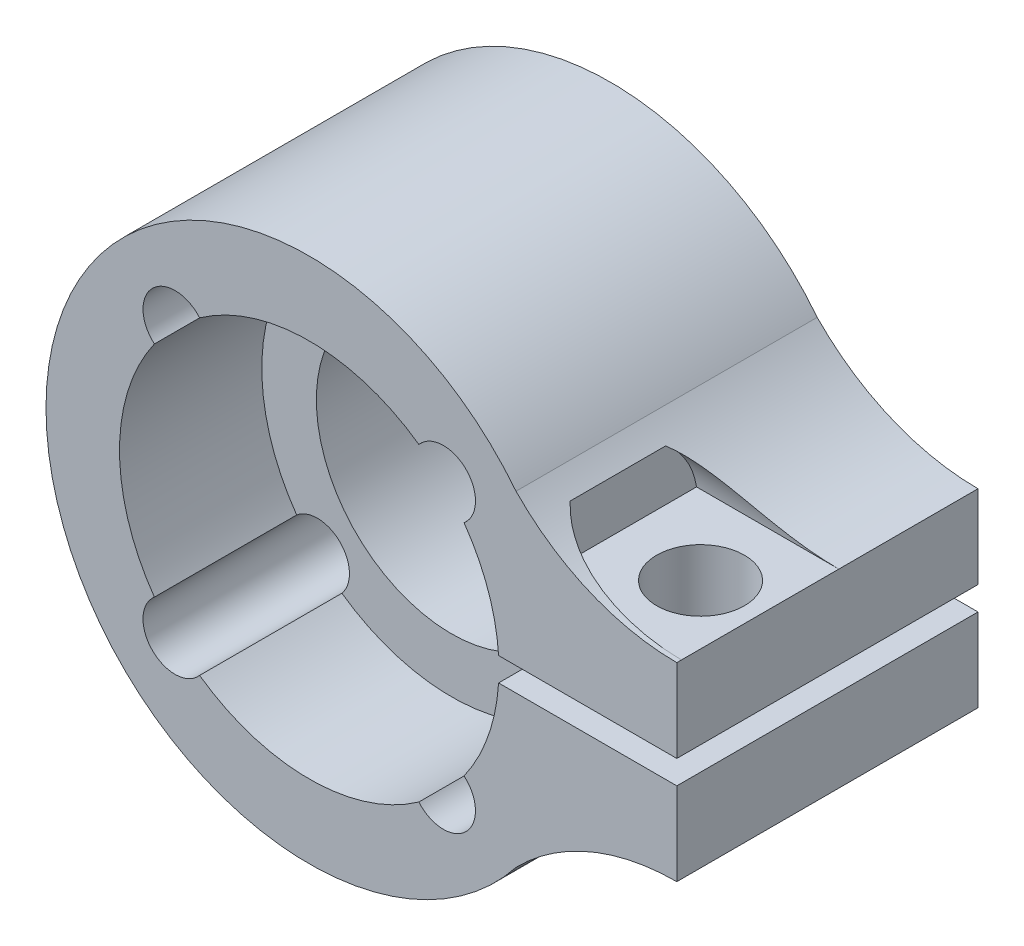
ISO-10303-21;
HEADER;
FILE_DESCRIPTION(('STEP AP214'),'2;1');
FILE_NAME('part.step','',(''),(''),'','','');
FILE_SCHEMA(('AUTOMOTIVE_DESIGN { 1 0 10303 214 1 1 1 1 }'));
ENDSEC;
DATA;
#1=APPLICATION_CONTEXT('core data for automotive mechanical design processes');
#2=APPLICATION_PROTOCOL_DEFINITION('international standard','automotive_design',2000,#1);
#3=PRODUCT_CONTEXT('',#1,'mechanical');
#4=PRODUCT('Part','Part','',(#3));
#5=PRODUCT_RELATED_PRODUCT_CATEGORY('part','',(#4));
#6=PRODUCT_DEFINITION_FORMATION('','',#4);
#7=PRODUCT_DEFINITION_CONTEXT('part definition',#1,'design');
#8=PRODUCT_DEFINITION('design','',#6,#7);
#9=PRODUCT_DEFINITION_SHAPE('','',#8);
#10=(LENGTH_UNIT() NAMED_UNIT(*) SI_UNIT(.MILLI.,.METRE.));
#11=(NAMED_UNIT(*) PLANE_ANGLE_UNIT() SI_UNIT($,.RADIAN.));
#12=(NAMED_UNIT(*) SI_UNIT($,.STERADIAN.) SOLID_ANGLE_UNIT());
#13=UNCERTAINTY_MEASURE_WITH_UNIT(LENGTH_MEASURE(1.E-05),#10,'distance_accuracy_value','');
#14=(GEOMETRIC_REPRESENTATION_CONTEXT(3) GLOBAL_UNCERTAINTY_ASSIGNED_CONTEXT((#13)) GLOBAL_UNIT_ASSIGNED_CONTEXT((#10,
#11,#12)) REPRESENTATION_CONTEXT('',''));
#15=CARTESIAN_POINT('',(0.,0.,0.));
#16=DIRECTION('',(0.,0.,1.));
#17=DIRECTION('',(1.,0.,0.));
#18=AXIS2_PLACEMENT_3D('',#15,#16,#17);
#19=CARTESIAN_POINT('',(0.,0.,-12.7));
#20=DIRECTION('',(0.,0.,1.));
#21=DIRECTION('',(1.,0.,0.));
#22=AXIS2_PLACEMENT_3D('',#19,#20,#21);
#23=CYLINDRICAL_SURFACE('',#22,5.7);
#24=CARTESIAN_POINT('',(0.,0.,-6.));
#25=DIRECTION('',(0.,0.,1.));
#26=DIRECTION('',(1.,0.,0.));
#27=AXIS2_PLACEMENT_3D('',#24,#25,#26);
#28=CIRCLE('',#27,5.7);
#29=CARTESIAN_POINT('',(5.67802782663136,-0.5,-6.));
#30=VERTEX_POINT('',#29);
#31=CARTESIAN_POINT('',(5.67802782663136,0.5,-6.));
#32=VERTEX_POINT('',#31);
#33=EDGE_CURVE('E504',#30,#32,#28,.F.);
#34=ORIENTED_EDGE('',*,*,#33,.F.);
#35=DIRECTION('',(0.,0.,1.));
#36=VECTOR('',#35,1.);
#37=CARTESIAN_POINT('',(5.67802782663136,-0.5,-12.7));
#38=LINE('',#37,#36);
#39=CARTESIAN_POINT('',(5.67802782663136,-0.5,-12.7));
#40=VERTEX_POINT('',#39);
#41=EDGE_CURVE('E404',#30,#40,#38,.F.);
#42=ORIENTED_EDGE('',*,*,#41,.T.);
#43=CARTESIAN_POINT('',(0.,0.,-12.7));
#44=DIRECTION('',(0.,0.,1.));
#45=DIRECTION('',(1.,0.,0.));
#46=AXIS2_PLACEMENT_3D('',#43,#44,#45);
#47=CIRCLE('',#46,5.7);
#48=CARTESIAN_POINT('',(5.67802782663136,0.5,-12.7));
#49=VERTEX_POINT('',#48);
#50=EDGE_CURVE('E395',#49,#40,#47,.T.);
#51=ORIENTED_EDGE('',*,*,#50,.F.);
#52=DIRECTION('',(0.,0.,1.));
#53=VECTOR('',#52,1.);
#54=CARTESIAN_POINT('',(5.67802782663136,0.5,-12.7));
#55=LINE('',#54,#53);
#56=EDGE_CURVE('E398',#49,#32,#55,.T.);
#57=ORIENTED_EDGE('',*,*,#56,.T.);
#58=EDGE_LOOP('',(#34,#42,#51,#57));
#59=FACE_BOUND('',#58,.T.);
#60=ADVANCED_FACE('F33',(#59),#23,.F.);
#61=CARTESIAN_POINT('',(0.,-0.5,-12.7));
#62=DIRECTION('',(0.,1.,0.));
#63=DIRECTION('',(0.,0.,1.));
#64=AXIS2_PLACEMENT_3D('',#61,#62,#63);
#65=PLANE('',#64);
#66=DIRECTION('',(0.,0.,1.));
#67=VECTOR('',#66,1.);
#68=CARTESIAN_POINT('',(7.98435971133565,-0.5,-6.));
#69=LINE('',#68,#67);
#70=CARTESIAN_POINT('',(7.98435971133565,-0.5,0.));
#71=VERTEX_POINT('',#70);
#72=CARTESIAN_POINT('',(7.98435971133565,-0.5,-6.));
#73=VERTEX_POINT('',#72);
#74=EDGE_CURVE('E189',#71,#73,#69,.F.);
#75=ORIENTED_EDGE('',*,*,#74,.F.);
#76=DIRECTION('',(-1.,0.,0.));
#77=VECTOR('',#76,1.);
#78=CARTESIAN_POINT('',(0.,-0.5,0.));
#79=LINE('',#78,#77);
#80=CARTESIAN_POINT('',(15.5,-0.5,0.));
#81=VERTEX_POINT('',#80);
#82=EDGE_CURVE('E232',#81,#71,#79,.T.);
#83=ORIENTED_EDGE('',*,*,#82,.F.);
#84=DIRECTION('',(0.,0.,1.));
#85=VECTOR('',#84,1.);
#86=CARTESIAN_POINT('',(15.5,-0.5,-12.7));
#87=LINE('',#86,#85);
#88=CARTESIAN_POINT('',(15.5,-0.5,-12.7));
#89=VERTEX_POINT('',#88);
#90=EDGE_CURVE('E236',#89,#81,#87,.T.);
#91=ORIENTED_EDGE('',*,*,#90,.F.);
#92=DIRECTION('',(-1.,0.,0.));
#93=VECTOR('',#92,1.);
#94=CARTESIAN_POINT('',(0.,-0.5,-12.7));
#95=LINE('',#94,#93);
#96=EDGE_CURVE('E218',#89,#40,#95,.T.);
#97=ORIENTED_EDGE('',*,*,#96,.T.);
#98=ORIENTED_EDGE('',*,*,#41,.F.);
#99=DIRECTION('',(1.,0.,0.));
#100=VECTOR('',#99,1.);
#101=CARTESIAN_POINT('',(0.,-0.5,-6.));
#102=LINE('',#101,#100);
#103=EDGE_CURVE('E48',#30,#73,#102,.T.);
#104=ORIENTED_EDGE('',*,*,#103,.T.);
#105=EDGE_LOOP('',(#75,#83,#91,#97,#98,#104));
#106=FACE_BOUND('',#105,.T.);
#107=CARTESIAN_POINT('',(13.,-0.499999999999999,-3.5));
#108=DIRECTION('',(0.,1.,0.));
#109=DIRECTION('',(0.,0.,1.));
#110=AXIS2_PLACEMENT_3D('',#107,#108,#109);
#111=CIRCLE('',#110,1.35254999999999);
#112=CARTESIAN_POINT('',(13.,-0.499999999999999,-2.14745000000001));
#113=VERTEX_POINT('',#112);
#114=EDGE_CURVE('E258',#113,#113,#111,.T.);
#115=ORIENTED_EDGE('',*,*,#114,.F.);
#116=EDGE_LOOP('',(#115));
#117=FACE_BOUND('',#116,.T.);
#118=ADVANCED_FACE('F301',(#106,#117),#65,.T.);
#119=CARTESIAN_POINT('',(15.5,-0.5,-12.7));
#120=DIRECTION('',(1.,0.,0.));
#121=DIRECTION('',(0.,0.,-1.));
#122=AXIS2_PLACEMENT_3D('',#119,#120,#121);
#123=PLANE('',#122);
#124=DIRECTION('',(0.,1.,0.));
#125=VECTOR('',#124,1.);
#126=CARTESIAN_POINT('',(15.5,-0.5,0.));
#127=LINE('',#126,#125);
#128=CARTESIAN_POINT('',(15.5,-4.,0.));
#129=VERTEX_POINT('',#128);
#130=EDGE_CURVE('E229',#129,#81,#127,.T.);
#131=ORIENTED_EDGE('',*,*,#130,.F.);
#132=DIRECTION('',(0.,0.,1.));
#133=VECTOR('',#132,1.);
#134=CARTESIAN_POINT('',(15.5,-4.,-12.7));
#135=LINE('',#134,#133);
#136=CARTESIAN_POINT('',(15.5,-4.,-12.7));
#137=VERTEX_POINT('',#136);
#138=EDGE_CURVE('E239',#137,#129,#135,.T.);
#139=ORIENTED_EDGE('',*,*,#138,.F.);
#140=DIRECTION('',(0.,1.,0.));
#141=VECTOR('',#140,1.);
#142=CARTESIAN_POINT('',(15.5,-0.5,-12.7));
#143=LINE('',#142,#141);
#144=EDGE_CURVE('E442',#137,#89,#143,.T.);
#145=ORIENTED_EDGE('',*,*,#144,.T.);
#146=ORIENTED_EDGE('',*,*,#90,.T.);
#147=EDGE_LOOP('',(#131,#139,#145,#146));
#148=FACE_BOUND('',#147,.T.);
#149=ADVANCED_FACE('F303',(#148),#123,.T.);
#150=CARTESIAN_POINT('',(15.5,-13.4475790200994,-12.7));
#151=DIRECTION('',(0.,0.,1.));
#152=DIRECTION('',(1.,0.,0.));
#153=AXIS2_PLACEMENT_3D('',#150,#151,#152);
#154=CYLINDRICAL_SURFACE('',#153,9.44757902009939);
#155=CARTESIAN_POINT('',(13.,-4.33677503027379,-2.14745000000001));
#156=CARTESIAN_POINT('',(12.920428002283,-4.35861121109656,-2.14745335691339));
#157=CARTESIAN_POINT('',(12.8410856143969,-4.38151425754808,-2.15449314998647));
#158=CARTESIAN_POINT('',(12.6851670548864,-4.42870287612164,-2.18221386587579));
#159=CARTESIAN_POINT('',(12.6085951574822,-4.45299044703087,-2.20291499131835));
#160=CARTESIAN_POINT('',(12.4604293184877,-4.50197454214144,-2.25723253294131));
#161=CARTESIAN_POINT('',(12.3888294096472,-4.52667053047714,-2.2908331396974));
#162=CARTESIAN_POINT('',(12.252410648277,-4.57542230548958,-2.37007784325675));
#163=CARTESIAN_POINT('',(12.1875904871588,-4.59947821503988,-2.41571960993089));
#164=CARTESIAN_POINT('',(12.066091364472,-4.6459152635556,-2.51838125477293));
#165=CARTESIAN_POINT('',(12.0094736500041,-4.66828325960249,-2.57547982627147));
#166=CARTESIAN_POINT('',(11.906792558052,-4.70980559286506,-2.69952176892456));
#167=CARTESIAN_POINT('',(11.8607269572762,-4.72896060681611,-2.76646306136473));
#168=CARTESIAN_POINT('',(11.7828596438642,-4.76188237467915,-2.90504273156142));
#169=CARTESIAN_POINT('',(11.7504845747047,-4.77586176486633,-2.97630723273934));
#170=CARTESIAN_POINT('',(11.6983802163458,-4.79857589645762,-3.12409554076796));
#171=CARTESIAN_POINT('',(11.6786423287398,-4.80731420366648,-3.2006157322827));
#172=CARTESIAN_POINT('',(11.6538330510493,-4.81833124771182,-3.35003068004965));
#173=CARTESIAN_POINT('',(11.6477021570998,-4.82107632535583,-3.42271626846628));
#174=CARTESIAN_POINT('',(11.6472133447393,-4.82129439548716,-3.56812567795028));
#175=CARTESIAN_POINT('',(11.6528522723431,-4.8187688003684,-3.64084948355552));
#176=CARTESIAN_POINT('',(11.6751489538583,-4.80886385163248,-3.78104815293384));
#177=CARTESIAN_POINT('',(11.6913300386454,-4.80169454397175,-3.84861488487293));
#178=CARTESIAN_POINT('',(11.7335933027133,-4.78320032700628,-3.97996595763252));
#179=CARTESIAN_POINT('',(11.7596766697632,-4.77187491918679,-4.04374984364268));
#180=CARTESIAN_POINT('',(11.8218428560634,-4.74533313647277,-4.1680766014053));
#181=CARTESIAN_POINT('',(11.8582264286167,-4.73000100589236,-4.22844379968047));
#182=CARTESIAN_POINT('',(11.939439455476,-4.69651711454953,-4.34231730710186));
#183=CARTESIAN_POINT('',(11.9842716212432,-4.67836444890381,-4.39582140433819));
#184=CARTESIAN_POINT('',(12.0848983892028,-4.63866491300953,-4.49877337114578));
#185=CARTESIAN_POINT('',(12.1412686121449,-4.61696471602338,-4.54759971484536));
#186=CARTESIAN_POINT('',(12.2609318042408,-4.57237399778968,-4.63519723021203));
#187=CARTESIAN_POINT('',(12.3242271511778,-4.54948306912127,-4.67396493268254));
#188=CARTESIAN_POINT('',(12.4603320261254,-4.50203996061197,-4.7427043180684));
#189=CARTESIAN_POINT('',(12.5334880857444,-4.47747274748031,-4.77198195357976));
#190=CARTESIAN_POINT('',(12.6840024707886,-4.42908940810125,-4.81746682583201));
#191=CARTESIAN_POINT('',(12.7613612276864,-4.40527335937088,-4.83367271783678));
#192=CARTESIAN_POINT('',(12.91897692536,-4.35902160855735,-4.85247375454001));
#193=CARTESIAN_POINT('',(12.9992549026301,-4.33660180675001,-4.85493331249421));
#194=CARTESIAN_POINT('',(13.1595924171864,-4.29410337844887,-4.84549879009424));
#195=CARTESIAN_POINT('',(13.2396519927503,-4.27402431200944,-4.83360741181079));
#196=CARTESIAN_POINT('',(13.3944384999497,-4.23728652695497,-4.79612680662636));
#197=CARTESIAN_POINT('',(13.4692541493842,-4.22053829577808,-4.7709923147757));
#198=CARTESIAN_POINT('',(13.6138488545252,-4.18989861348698,-4.70780858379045));
#199=CARTESIAN_POINT('',(13.68362900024,-4.17600654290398,-4.66976214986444));
#200=CARTESIAN_POINT('',(13.8133418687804,-4.15155096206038,-4.58338069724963));
#201=CARTESIAN_POINT('',(13.8735433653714,-4.14088333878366,-4.53547829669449));
#202=CARTESIAN_POINT('',(13.9851526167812,-4.12206585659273,-4.42992630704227));
#203=CARTESIAN_POINT('',(14.0365613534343,-4.11391571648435,-4.37227780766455));
#204=CARTESIAN_POINT('',(14.1280258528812,-4.10003700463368,-4.25010637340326));
#205=CARTESIAN_POINT('',(14.1682834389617,-4.09426431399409,-4.18573939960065));
#206=CARTESIAN_POINT('',(14.2375170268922,-4.08466744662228,-4.05106702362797));
#207=CARTESIAN_POINT('',(14.2664934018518,-4.08084320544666,-3.98076181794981));
#208=CARTESIAN_POINT('',(14.3121708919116,-4.0749410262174,-3.83658547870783));
#209=CARTESIAN_POINT('',(14.3289317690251,-4.07285457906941,-3.76273361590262));
#210=CARTESIAN_POINT('',(14.349912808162,-4.07025730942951,-3.61324210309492));
#211=CARTESIAN_POINT('',(14.3541329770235,-4.06974648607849,-3.53760245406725));
#212=CARTESIAN_POINT('',(14.3499074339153,-4.07026380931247,-3.38669109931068));
#213=CARTESIAN_POINT('',(14.3414630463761,-4.07129179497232,-3.31141935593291));
#214=CARTESIAN_POINT('',(14.3121613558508,-4.07495910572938,-3.16337255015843));
#215=CARTESIAN_POINT('',(14.2913040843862,-4.07759842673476,-3.09059748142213));
#216=CARTESIAN_POINT('',(14.2377999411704,-4.08465619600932,-2.9496114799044));
#217=CARTESIAN_POINT('',(14.2051532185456,-4.08907462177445,-2.88140048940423));
#218=CARTESIAN_POINT('',(14.129058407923,-4.0999194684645,-2.75147768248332));
#219=CARTESIAN_POINT('',(14.0856109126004,-4.10634577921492,-2.68976550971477));
#220=CARTESIAN_POINT('',(13.9892356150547,-4.12144837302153,-2.57455655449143));
#221=CARTESIAN_POINT('',(13.9363065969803,-4.13012494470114,-2.52106082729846));
#222=CARTESIAN_POINT('',(13.8225858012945,-4.14992582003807,-2.4237351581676));
#223=CARTESIAN_POINT('',(13.7617924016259,-4.16105062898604,-2.37990721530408));
#224=CARTESIAN_POINT('',(13.6338306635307,-4.18591438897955,-2.30280935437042));
#225=CARTESIAN_POINT('',(13.5666263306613,-4.1996685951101,-2.26960423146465));
#226=CARTESIAN_POINT('',(13.4282106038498,-4.22969224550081,-2.2148708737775));
#227=CARTESIAN_POINT('',(13.3570030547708,-4.24595930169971,-2.19333163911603));
#228=CARTESIAN_POINT('',(13.2378427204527,-4.27469817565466,-2.16765678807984));
#229=CARTESIAN_POINT('',(13.1904436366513,-4.28651419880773,-2.16007112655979));
#230=CARTESIAN_POINT('',(13.0953356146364,-4.3110177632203,-2.14996674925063));
#231=CARTESIAN_POINT('',(13.0476266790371,-4.32370529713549,-2.14744799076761));
#232=CARTESIAN_POINT('',(13.,-4.33677503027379,-2.14745000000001));
#233=B_SPLINE_CURVE_WITH_KNOTS('',3,(#155,#156,#157,#158,#159,#160,#161,#162,#163,#164,#165,
#166,#167,#168,#169,#170,#171,#172,#173,#174,#175,#176,#177,#178,#179,#180,#181,#182,#183,#184,
#185,#186,#187,#188,#189,#190,#191,#192,#193,#194,#195,#196,#197,#198,#199,#200,#201,#202,#203,
#204,#205,#206,#207,#208,#209,#210,#211,#212,#213,#214,#215,#216,#217,#218,#219,#220,#221,#222,
#223,#224,#225,#226,#227,#228,#229,#230,#231,#232),.UNSPECIFIED.,.T.,.F.,(4,2,2,2,2,2,2,2,2,2,2,
2,2,2,2,2,2,2,2,2,2,2,2,2,2,2,2,2,2,2,2,2,2,2,2,2,2,2,4),(0.,0.247356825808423,
0.495080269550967,0.742501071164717,0.98987402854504,1.23900816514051,1.48808976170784,
1.72534609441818,1.9624408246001,2.18030983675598,2.39812047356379,2.60670856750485,
2.81532168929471,3.03079828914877,3.24634416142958,3.47834590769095,3.71042756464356,
3.95689267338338,4.2033831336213,4.45230061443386,4.70117123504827,4.94200525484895,
5.18278698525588,5.4146624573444,5.64651202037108,5.87384080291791,6.10116206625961,
6.32736359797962,6.55356500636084,6.77974276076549,7.00591994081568,7.23209426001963,
7.45825617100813,7.68444710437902,7.91068476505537,8.13827718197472,8.36565462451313,
8.51370775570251,8.66175963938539),.UNSPECIFIED.);
#234=CARTESIAN_POINT('',(13.,-4.33677503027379,-2.14745000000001));
#235=VERTEX_POINT('',#234);
#236=EDGE_CURVE('E250',#235,#235,#233,.T.);
#237=ORIENTED_EDGE('',*,*,#236,.F.);
#238=EDGE_LOOP('',(#237));
#239=FACE_BOUND('',#238,.T.);
#240=CARTESIAN_POINT('',(15.5,-13.4475790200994,0.));
#241=DIRECTION('',(0.,0.,-1.));
#242=DIRECTION('',(1.,0.,0.));
#243=AXIS2_PLACEMENT_3D('',#240,#241,#242);
#244=CIRCLE('',#243,9.44757902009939);
#245=CARTESIAN_POINT('',(8.71986454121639,-6.86833039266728,0.));
#246=VERTEX_POINT('',#245);
#247=EDGE_CURVE('E226',#246,#129,#244,.T.);
#248=ORIENTED_EDGE('',*,*,#247,.F.);
#249=DIRECTION('',(0.,0.,1.));
#250=VECTOR('',#249,1.);
#251=CARTESIAN_POINT('',(8.71986454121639,-6.86833039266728,-12.7));
#252=LINE('',#251,#250);
#253=CARTESIAN_POINT('',(8.71986454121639,-6.86833039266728,-12.7));
#254=VERTEX_POINT('',#253);
#255=EDGE_CURVE('E241',#254,#246,#252,.T.);
#256=ORIENTED_EDGE('',*,*,#255,.F.);
#257=CARTESIAN_POINT('',(15.5,-13.4475790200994,-12.7));
#258=DIRECTION('',(0.,0.,-1.));
#259=DIRECTION('',(1.,0.,0.));
#260=AXIS2_PLACEMENT_3D('',#257,#258,#259);
#261=CIRCLE('',#260,9.44757902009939);
#262=EDGE_CURVE('E441',#254,#137,#261,.T.);
#263=ORIENTED_EDGE('',*,*,#262,.T.);
#264=ORIENTED_EDGE('',*,*,#138,.T.);
#265=EDGE_LOOP('',(#248,#256,#263,#264));
#266=FACE_BOUND('',#265,.T.);
#267=ADVANCED_FACE('F261',(#239,#266),#154,.F.);
#268=CARTESIAN_POINT('',(0.,0.,-12.7));
#269=DIRECTION('',(0.,0.,1.));
#270=DIRECTION('',(1.,0.,0.));
#271=AXIS2_PLACEMENT_3D('',#268,#269,#270);
#272=CYLINDRICAL_SURFACE('',#271,11.1);
#273=CARTESIAN_POINT('',(0.,0.,0.));
#274=DIRECTION('',(0.,0.,1.));
#275=DIRECTION('',(1.,0.,0.));
#276=AXIS2_PLACEMENT_3D('',#273,#274,#275);
#277=CIRCLE('',#276,11.1);
#278=CARTESIAN_POINT('',(8.71986454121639,6.86833039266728,0.));
#279=VERTEX_POINT('',#278);
#280=EDGE_CURVE('E223',#279,#246,#277,.T.);
#281=ORIENTED_EDGE('',*,*,#280,.F.);
#282=DIRECTION('',(0.,0.,1.));
#283=VECTOR('',#282,1.);
#284=CARTESIAN_POINT('',(8.71986454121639,6.86833039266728,-12.7));
#285=LINE('',#284,#283);
#286=CARTESIAN_POINT('',(8.71986454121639,6.86833039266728,-12.7));
#287=VERTEX_POINT('',#286);
#288=EDGE_CURVE('E243',#287,#279,#285,.T.);
#289=ORIENTED_EDGE('',*,*,#288,.F.);
#290=CARTESIAN_POINT('',(0.,0.,-12.7));
#291=DIRECTION('',(0.,0.,1.));
#292=DIRECTION('',(1.,0.,0.));
#293=AXIS2_PLACEMENT_3D('',#290,#291,#292);
#294=CIRCLE('',#293,11.1);
#295=EDGE_CURVE('E382',#287,#254,#294,.T.);
#296=ORIENTED_EDGE('',*,*,#295,.T.);
#297=ORIENTED_EDGE('',*,*,#255,.T.);
#298=EDGE_LOOP('',(#281,#289,#296,#297));
#299=FACE_BOUND('',#298,.T.);
#300=ADVANCED_FACE('F310',(#299),#272,.T.);
#301=CARTESIAN_POINT('',(15.5,13.4475790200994,-12.7));
#302=DIRECTION('',(0.,0.,1.));
#303=DIRECTION('',(1.,0.,0.));
#304=AXIS2_PLACEMENT_3D('',#301,#302,#303);
#305=CYLINDRICAL_SURFACE('',#304,9.44757902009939);
#306=CARTESIAN_POINT('',(15.5,4.,-6.83230083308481));
#307=CARTESIAN_POINT('',(15.3705636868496,3.9999983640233,-6.8322872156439));
#308=CARTESIAN_POINT('',(15.2411279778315,4.00266000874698,-6.831867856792));
#309=CARTESIAN_POINT('',(14.9824770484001,4.01329761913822,-6.83011883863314));
#310=CARTESIAN_POINT('',(14.8532618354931,4.02127376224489,-6.82878914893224));
#311=CARTESIAN_POINT('',(14.5951169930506,4.04254154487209,-6.82511832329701));
#312=CARTESIAN_POINT('',(14.4661879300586,4.05583988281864,-6.82277591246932));
#313=CARTESIAN_POINT('',(14.2090229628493,4.08772214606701,-6.81687695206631));
#314=CARTESIAN_POINT('',(14.0807870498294,4.10630600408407,-6.81332041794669));
#315=CARTESIAN_POINT('',(13.6953068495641,4.17029327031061,-6.80037390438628));
#316=CARTESIAN_POINT('',(13.4394222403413,4.22375705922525,-6.78872903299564));
#317=CARTESIAN_POINT('',(12.9336543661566,4.35150531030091,-6.75628903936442));
#318=CARTESIAN_POINT('',(12.6837666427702,4.42577374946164,-6.73550095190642));
#319=CARTESIAN_POINT('',(12.2862976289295,4.56193657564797,-6.69072383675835));
#320=CARTESIAN_POINT('',(12.1361187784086,4.61771085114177,-6.6709951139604));
#321=CARTESIAN_POINT('',(11.8396370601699,4.73643834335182,-6.6248842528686));
#322=CARTESIAN_POINT('',(11.6933341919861,4.79939155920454,-6.59850211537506));
#323=CARTESIAN_POINT('',(11.4058287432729,4.93174098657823,-6.53757277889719));
#324=CARTESIAN_POINT('',(11.2646149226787,5.00112161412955,-6.50304503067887));
#325=CARTESIAN_POINT('',(10.988020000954,5.14558570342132,-6.42400044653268));
#326=CARTESIAN_POINT('',(10.8526367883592,5.22066707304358,-6.37948726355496));
#327=CARTESIAN_POINT('',(10.6247280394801,5.3543159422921,-6.29218846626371));
#328=CARTESIAN_POINT('',(10.5305235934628,5.41185032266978,-6.25219851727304));
#329=CARTESIAN_POINT('',(10.3465579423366,5.5285742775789,-6.16508141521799));
#330=CARTESIAN_POINT('',(10.2567952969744,5.58776330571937,-6.11795659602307));
#331=CARTESIAN_POINT('',(10.082704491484,5.70673023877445,-6.0159698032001));
#332=CARTESIAN_POINT('',(9.99835933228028,5.76650554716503,-5.96113394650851));
#333=CARTESIAN_POINT('',(9.83564715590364,5.88570047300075,-5.84295653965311));
#334=CARTESIAN_POINT('',(9.75727511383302,5.94512034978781,-5.77962226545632));
#335=CARTESIAN_POINT('',(9.6506907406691,6.02841787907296,-5.68314731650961));
#336=CARTESIAN_POINT('',(9.61965172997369,6.05300181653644,-5.65369539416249));
#337=CARTESIAN_POINT('',(9.55884887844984,6.10176445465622,-5.59314451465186));
#338=CARTESIAN_POINT('',(9.52908569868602,6.12594294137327,-5.56204472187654));
#339=CARTESIAN_POINT('',(9.5,6.14985681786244,-5.5301137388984));
#340=B_SPLINE_CURVE_WITH_KNOTS('',3,(#306,#307,#308,#309,#310,#311,#312,#313,#314,#315,#316,
#317,#318,#319,#320,#321,#322,#323,#324,#325,#326,#327,#328,#329,#330,#331,#332,#333,#334,#335,
#336,#337,#338,#339),.UNSPECIFIED.,.F.,.F.,(4,2,2,2,2,2,2,2,2,2,2,2,2,2,2,2,4),(0.,
0.388279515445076,0.77657199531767,1.16535471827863,1.55413249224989,2.33808539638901,
3.12143618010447,3.60538014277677,4.08932404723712,4.57212384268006,5.05474730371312,
5.40669311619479,5.75852405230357,6.10919083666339,6.45955928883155,6.60756402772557,
6.75564454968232),.UNSPECIFIED.);
#341=CARTESIAN_POINT('',(15.5,4.,-6.83230083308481));
#342=VERTEX_POINT('',#341);
#343=CARTESIAN_POINT('',(9.5,6.14985681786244,-5.5301137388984));
#344=VERTEX_POINT('',#343);
#345=EDGE_CURVE('E341',#342,#344,#340,.T.);
#346=ORIENTED_EDGE('',*,*,#345,.F.);
#347=DIRECTION('',(0.,0.,1.));
#348=VECTOR('',#347,1.);
#349=CARTESIAN_POINT('',(15.5,4.,-12.7));
#350=LINE('',#349,#348);
#351=CARTESIAN_POINT('',(15.5,4.,-12.7));
#352=VERTEX_POINT('',#351);
#353=EDGE_CURVE('E245',#352,#342,#350,.T.);
#354=ORIENTED_EDGE('',*,*,#353,.F.);
#355=CARTESIAN_POINT('',(15.5,13.4475790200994,-12.7));
#356=DIRECTION('',(0.,0.,-1.));
#357=DIRECTION('',(-1.,0.,0.));
#358=AXIS2_PLACEMENT_3D('',#355,#356,#357);
#359=CIRCLE('',#358,9.44757902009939);
#360=EDGE_CURVE('E377',#352,#287,#359,.T.);
#361=ORIENTED_EDGE('',*,*,#360,.T.);
#362=ORIENTED_EDGE('',*,*,#288,.T.);
#363=CARTESIAN_POINT('',(15.5,13.4475790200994,0.));
#364=DIRECTION('',(0.,0.,-1.));
#365=DIRECTION('',(-1.,0.,0.));
#366=AXIS2_PLACEMENT_3D('',#363,#364,#365);
#367=CIRCLE('',#366,9.44757902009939);
#368=CARTESIAN_POINT('',(15.5,4.,0.));
#369=VERTEX_POINT('',#368);
#370=EDGE_CURVE('E212',#369,#279,#367,.T.);
#371=ORIENTED_EDGE('',*,*,#370,.F.);
#372=CARTESIAN_POINT('',(15.5,4.,-0.200000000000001));
#373=VERTEX_POINT('',#372);
#374=EDGE_CURVE('E248',#373,#369,#350,.T.);
#375=ORIENTED_EDGE('',*,*,#374,.F.);
#376=CARTESIAN_POINT('',(9.5,6.14985681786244,-1.50218709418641));
#377=CARTESIAN_POINT('',(9.56992811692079,6.09232780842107,-1.42538547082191));
#378=CARTESIAN_POINT('',(9.64377435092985,6.03333195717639,-1.35344956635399));
#379=CARTESIAN_POINT('',(9.79816995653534,5.91397183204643,-1.21894434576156));
#380=CARTESIAN_POINT('',(9.87870317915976,5.85361109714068,-1.15635342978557));
#381=CARTESIAN_POINT('',(10.0445468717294,5.7336206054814,-1.04060636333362));
#382=CARTESIAN_POINT('',(10.1297779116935,5.67399201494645,-0.987333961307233));
#383=CARTESIAN_POINT('',(10.3052530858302,5.55564888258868,-0.888456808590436));
#384=CARTESIAN_POINT('',(10.3955007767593,5.49693502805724,-0.842857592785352));
#385=CARTESIAN_POINT('',(10.6179335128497,5.35772874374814,-0.741429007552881));
#386=CARTESIAN_POINT('',(10.7522212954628,5.27811179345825,-0.68900334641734));
#387=CARTESIAN_POINT('',(11.027627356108,5.12414454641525,-0.595755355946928));
#388=CARTESIAN_POINT('',(11.1687473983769,5.04979562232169,-0.554936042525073));
#389=CARTESIAN_POINT('',(11.4575230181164,4.90701387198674,-0.482623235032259));
#390=CARTESIAN_POINT('',(11.6052172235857,4.83862578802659,-0.451196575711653));
#391=CARTESIAN_POINT('',(11.9051971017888,4.70910870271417,-0.396200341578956));
#392=CARTESIAN_POINT('',(12.0574842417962,4.64798205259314,-0.372633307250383));
#393=CARTESIAN_POINT('',(12.438126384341,4.50666194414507,-0.322147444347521));
#394=CARTESIAN_POINT('',(12.6686469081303,4.43097912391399,-0.298844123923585));
#395=CARTESIAN_POINT('',(13.135586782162,4.29742329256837,-0.261557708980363));
#396=CARTESIAN_POINT('',(13.372009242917,4.23955989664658,-0.247579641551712));
#397=CARTESIAN_POINT('',(13.848274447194,4.1423395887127,-0.225932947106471));
#398=CARTESIAN_POINT('',(14.0881071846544,4.10293686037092,-0.218248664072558));
#399=CARTESIAN_POINT('',(14.5700627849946,4.04274573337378,-0.207092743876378));
#400=CARTESIAN_POINT('',(14.8121840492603,4.02194518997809,-0.203618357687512));
#401=CARTESIAN_POINT('',(15.1288928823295,4.0069987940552,-0.201145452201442));
#402=CARTESIAN_POINT('',(15.2031349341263,4.00437287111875,-0.200714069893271));
#403=CARTESIAN_POINT('',(15.3515824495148,4.00087461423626,-0.200141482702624));
#404=CARTESIAN_POINT('',(15.4257878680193,4.00000041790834,-0.199999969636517));
#405=CARTESIAN_POINT('',(15.5,4.,-0.2));
#406=B_SPLINE_CURVE_WITH_KNOTS('',3,(#376,#377,#378,#379,#380,#381,#382,#383,#384,#385,#386,
#387,#388,#389,#390,#391,#392,#393,#394,#395,#396,#397,#398,#399,#400,#401,#402,#403,#404,#405),
.UNSPECIFIED.,.F.,.F.,(4,2,2,2,2,2,2,2,2,2,2,2,2,2,4),(0.,0.355847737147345,0.710859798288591,
1.06106592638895,1.4115235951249,1.90479876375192,2.39820199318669,2.89503680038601,
3.39203204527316,4.12221532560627,4.85279191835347,5.58154560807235,6.30982317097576,
6.53267790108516,6.75529557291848),.UNSPECIFIED.);
#407=CARTESIAN_POINT('',(9.5,6.14985681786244,-1.50218709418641));
#408=VERTEX_POINT('',#407);
#409=EDGE_CURVE('E339',#408,#373,#406,.T.);
#410=ORIENTED_EDGE('',*,*,#409,.F.);
#411=DIRECTION('',(0.,0.,1.));
#412=VECTOR('',#411,1.);
#413=CARTESIAN_POINT('',(9.5,6.14985681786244,-12.7));
#414=LINE('',#413,#412);
#415=EDGE_CURVE('E238',#344,#408,#414,.T.);
#416=ORIENTED_EDGE('',*,*,#415,.F.);
#417=EDGE_LOOP('',(#346,#354,#361,#362,#371,#375,#410,#416));
#418=FACE_BOUND('',#417,.T.);
#419=ADVANCED_FACE('F358',(#418),#305,.F.);
#420=CARTESIAN_POINT('',(15.5,0.5,-12.7));
#421=DIRECTION('',(1.,0.,0.));
#422=DIRECTION('',(0.,0.,-1.));
#423=AXIS2_PLACEMENT_3D('',#420,#421,#422);
#424=PLANE('',#423);
#425=DIRECTION('',(0.,1.,0.));
#426=VECTOR('',#425,1.);
#427=CARTESIAN_POINT('',(15.5,0.5,0.));
#428=LINE('',#427,#426);
#429=CARTESIAN_POINT('',(15.5,0.5,0.));
#430=VERTEX_POINT('',#429);
#431=EDGE_CURVE('E209',#430,#369,#428,.T.);
#432=ORIENTED_EDGE('',*,*,#431,.F.);
#433=DIRECTION('',(0.,0.,1.));
#434=VECTOR('',#433,1.);
#435=CARTESIAN_POINT('',(15.5,0.5,-12.7));
#436=LINE('',#435,#434);
#437=CARTESIAN_POINT('',(15.5,0.5,-12.7));
#438=VERTEX_POINT('',#437);
#439=EDGE_CURVE('E207',#438,#430,#436,.T.);
#440=ORIENTED_EDGE('',*,*,#439,.F.);
#441=DIRECTION('',(0.,1.,0.));
#442=VECTOR('',#441,1.);
#443=CARTESIAN_POINT('',(15.5,0.5,-12.7));
#444=LINE('',#443,#442);
#445=EDGE_CURVE('E437',#438,#352,#444,.T.);
#446=ORIENTED_EDGE('',*,*,#445,.T.);
#447=ORIENTED_EDGE('',*,*,#353,.T.);
#448=DIRECTION('',(0.,0.,-1.));
#449=VECTOR('',#448,1.);
#450=CARTESIAN_POINT('',(15.5,4.,-0.2));
#451=LINE('',#450,#449);
#452=EDGE_CURVE('E335',#373,#342,#451,.T.);
#453=ORIENTED_EDGE('',*,*,#452,.F.);
#454=ORIENTED_EDGE('',*,*,#374,.T.);
#455=EDGE_LOOP('',(#432,#440,#446,#447,#453,#454));
#456=FACE_BOUND('',#455,.T.);
#457=ADVANCED_FACE('F361',(#456),#424,.T.);
#458=CARTESIAN_POINT('',(0.,0.5,-12.7));
#459=DIRECTION('',(0.,-1.,0.));
#460=DIRECTION('',(0.,0.,-1.));
#461=AXIS2_PLACEMENT_3D('',#458,#459,#460);
#462=PLANE('',#461);
#463=DIRECTION('',(0.,0.,1.));
#464=VECTOR('',#463,1.);
#465=CARTESIAN_POINT('',(7.98435971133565,0.5,-6.));
#466=LINE('',#465,#464);
#467=CARTESIAN_POINT('',(7.98435971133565,0.5,-6.));
#468=VERTEX_POINT('',#467);
#469=CARTESIAN_POINT('',(7.98435971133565,0.5,0.));
#470=VERTEX_POINT('',#469);
#471=EDGE_CURVE('E179',#468,#470,#466,.T.);
#472=ORIENTED_EDGE('',*,*,#471,.F.);
#473=DIRECTION('',(-1.,0.,0.));
#474=VECTOR('',#473,1.);
#475=CARTESIAN_POINT('',(0.,0.5,-6.));
#476=LINE('',#475,#474);
#477=EDGE_CURVE('E448',#468,#32,#476,.T.);
#478=ORIENTED_EDGE('',*,*,#477,.T.);
#479=ORIENTED_EDGE('',*,*,#56,.F.);
#480=DIRECTION('',(1.,0.,0.));
#481=VECTOR('',#480,1.);
#482=CARTESIAN_POINT('',(0.,0.5,-12.7));
#483=LINE('',#482,#481);
#484=EDGE_CURVE('E235',#49,#438,#483,.T.);
#485=ORIENTED_EDGE('',*,*,#484,.T.);
#486=ORIENTED_EDGE('',*,*,#439,.T.);
#487=DIRECTION('',(1.,0.,0.));
#488=VECTOR('',#487,1.);
#489=CARTESIAN_POINT('',(0.,0.5,0.));
#490=LINE('',#489,#488);
#491=EDGE_CURVE('E196',#470,#430,#490,.T.);
#492=ORIENTED_EDGE('',*,*,#491,.F.);
#493=EDGE_LOOP('',(#472,#478,#479,#485,#486,#492));
#494=FACE_BOUND('',#493,.T.);
#495=CARTESIAN_POINT('',(13.,0.5,-3.5));
#496=DIRECTION('',(0.,-1.,0.));
#497=DIRECTION('',(0.,0.,-1.));
#498=AXIS2_PLACEMENT_3D('',#495,#496,#497);
#499=CIRCLE('',#498,1.85);
#500=CARTESIAN_POINT('',(13.,0.5,-5.35));
#501=VERTEX_POINT('',#500);
#502=EDGE_CURVE('E257',#501,#501,#499,.T.);
#503=ORIENTED_EDGE('',*,*,#502,.F.);
#504=EDGE_LOOP('',(#503));
#505=FACE_BOUND('',#504,.T.);
#506=ADVANCED_FACE('F35',(#494,#505),#462,.T.);
#507=CARTESIAN_POINT('',(15.5,-13.4475790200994,-12.7));
#508=DIRECTION('',(0.,0.,1.));
#509=DIRECTION('',(1.,0.,0.));
#510=AXIS2_PLACEMENT_3D('',#507,#508,#509);
#511=PLANE('',#510);
#512=CARTESIAN_POINT('',(-5.65651622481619,5.65719225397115,-12.7));
#513=DIRECTION('',(0.,0.,1.));
#514=DIRECTION('',(1.,0.,0.));
#515=AXIS2_PLACEMENT_3D('',#512,#513,#514);
#516=CIRCLE('',#515,1.35255);
#517=CARTESIAN_POINT('',(-4.3039662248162,5.65719225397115,-12.7));
#518=VERTEX_POINT('',#517);
#519=EDGE_CURVE('E418',#518,#518,#516,.T.);
#520=ORIENTED_EDGE('',*,*,#519,.T.);
#521=EDGE_LOOP('',(#520));
#522=FACE_BOUND('',#521,.T.);
#523=CARTESIAN_POINT('',(5.65719225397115,5.65651622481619,-12.7));
#524=DIRECTION('',(0.,0.,1.));
#525=DIRECTION('',(1.,0.,0.));
#526=AXIS2_PLACEMENT_3D('',#523,#524,#525);
#527=CIRCLE('',#526,1.35255);
#528=CARTESIAN_POINT('',(7.00974225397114,5.65651622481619,-12.7));
#529=VERTEX_POINT('',#528);
#530=EDGE_CURVE('E424',#529,#529,#527,.T.);
#531=ORIENTED_EDGE('',*,*,#530,.T.);
#532=EDGE_LOOP('',(#531));
#533=FACE_BOUND('',#532,.T.);
#534=CARTESIAN_POINT('',(5.65651622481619,-5.65719225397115,-12.7));
#535=DIRECTION('',(0.,0.,1.));
#536=DIRECTION('',(1.,0.,0.));
#537=AXIS2_PLACEMENT_3D('',#534,#535,#536);
#538=CIRCLE('',#537,1.35255);
#539=CARTESIAN_POINT('',(7.00906622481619,-5.65719225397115,-12.7));
#540=VERTEX_POINT('',#539);
#541=EDGE_CURVE('E428',#540,#540,#538,.T.);
#542=ORIENTED_EDGE('',*,*,#541,.T.);
#543=EDGE_LOOP('',(#542));
#544=FACE_BOUND('',#543,.T.);
#545=CARTESIAN_POINT('',(-5.65719225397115,-5.65651622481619,-12.7));
#546=DIRECTION('',(0.,0.,1.));
#547=DIRECTION('',(1.,0.,0.));
#548=AXIS2_PLACEMENT_3D('',#545,#546,#547);
#549=CIRCLE('',#548,1.35255);
#550=CARTESIAN_POINT('',(-4.30464225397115,-5.65651622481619,-12.7));
#551=VERTEX_POINT('',#550);
#552=EDGE_CURVE('E215',#551,#551,#549,.T.);
#553=ORIENTED_EDGE('',*,*,#552,.T.);
#554=EDGE_LOOP('',(#553));
#555=FACE_BOUND('',#554,.T.);
#556=ORIENTED_EDGE('',*,*,#484,.F.);
#557=ORIENTED_EDGE('',*,*,#50,.T.);
#558=ORIENTED_EDGE('',*,*,#96,.F.);
#559=ORIENTED_EDGE('',*,*,#144,.F.);
#560=ORIENTED_EDGE('',*,*,#262,.F.);
#561=ORIENTED_EDGE('',*,*,#295,.F.);
#562=ORIENTED_EDGE('',*,*,#360,.F.);
#563=ORIENTED_EDGE('',*,*,#445,.F.);
#564=EDGE_LOOP('',(#556,#557,#558,#559,#560,#561,#562,#563));
#565=FACE_BOUND('',#564,.T.);
#566=ADVANCED_FACE('F295',(#522,#533,#544,#555,#565),#511,.F.);
#567=CARTESIAN_POINT('',(15.5,-13.4475790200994,0.));
#568=DIRECTION('',(0.,0.,1.));
#569=DIRECTION('',(1.,0.,0.));
#570=AXIS2_PLACEMENT_3D('',#567,#568,#569);
#571=PLANE('',#570);
#572=CARTESIAN_POINT('',(0.,0.,0.));
#573=DIRECTION('',(0.,0.,1.));
#574=DIRECTION('',(1.,0.,0.));
#575=AXIS2_PLACEMENT_3D('',#572,#573,#574);
#576=CIRCLE('',#575,8.);
#577=CARTESIAN_POINT('',(6.52925594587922,4.62264175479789,0.));
#578=VERTEX_POINT('',#577);
#579=EDGE_CURVE('E182',#470,#578,#576,.T.);
#580=ORIENTED_EDGE('',*,*,#579,.F.);
#581=ORIENTED_EDGE('',*,*,#491,.T.);
#582=ORIENTED_EDGE('',*,*,#431,.T.);
#583=ORIENTED_EDGE('',*,*,#370,.T.);
#584=ORIENTED_EDGE('',*,*,#280,.T.);
#585=ORIENTED_EDGE('',*,*,#247,.T.);
#586=ORIENTED_EDGE('',*,*,#130,.T.);
#587=ORIENTED_EDGE('',*,*,#82,.T.);
#588=CARTESIAN_POINT('',(6.52870346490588,-4.62342200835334,0.));
#589=VERTEX_POINT('',#588);
#590=EDGE_CURVE('E204',#589,#71,#576,.T.);
#591=ORIENTED_EDGE('',*,*,#590,.F.);
#592=CARTESIAN_POINT('',(5.65651622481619,-5.65719225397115,0.));
#593=DIRECTION('',(0.,0.,1.));
#594=DIRECTION('',(1.,0.,0.));
#595=AXIS2_PLACEMENT_3D('',#592,#593,#594);
#596=CIRCLE('',#595,1.35254999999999);
#597=CARTESIAN_POINT('',(4.62264175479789,-6.52925594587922,0.));
#598=VERTEX_POINT('',#597);
#599=EDGE_CURVE('E431',#598,#589,#596,.T.);
#600=ORIENTED_EDGE('',*,*,#599,.F.);
#601=CARTESIAN_POINT('',(-4.62342200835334,-6.52870346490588,0.));
#602=VERTEX_POINT('',#601);
#603=EDGE_CURVE('E487',#602,#598,#576,.T.);
#604=ORIENTED_EDGE('',*,*,#603,.F.);
#605=CARTESIAN_POINT('',(-5.65719225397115,-5.65651622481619,0.));
#606=DIRECTION('',(0.,0.,1.));
#607=DIRECTION('',(1.,0.,0.));
#608=AXIS2_PLACEMENT_3D('',#605,#606,#607);
#609=CIRCLE('',#608,1.35254999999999);
#610=CARTESIAN_POINT('',(-6.52925594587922,-4.62264175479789,0.));
#611=VERTEX_POINT('',#610);
#612=EDGE_CURVE('E210',#611,#602,#609,.T.);
#613=ORIENTED_EDGE('',*,*,#612,.F.);
#614=CARTESIAN_POINT('',(-6.52870346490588,4.62342200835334,0.));
#615=VERTEX_POINT('',#614);
#616=EDGE_CURVE('E485',#615,#611,#576,.T.);
#617=ORIENTED_EDGE('',*,*,#616,.F.);
#618=CARTESIAN_POINT('',(-5.65651622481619,5.65719225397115,0.));
#619=DIRECTION('',(0.,0.,1.));
#620=DIRECTION('',(1.,0.,0.));
#621=AXIS2_PLACEMENT_3D('',#618,#619,#620);
#622=CIRCLE('',#621,1.35254999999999);
#623=CARTESIAN_POINT('',(-4.62264175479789,6.52925594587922,0.));
#624=VERTEX_POINT('',#623);
#625=EDGE_CURVE('E421',#624,#615,#622,.T.);
#626=ORIENTED_EDGE('',*,*,#625,.F.);
#627=CARTESIAN_POINT('',(4.62342200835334,6.52870346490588,0.));
#628=VERTEX_POINT('',#627);
#629=EDGE_CURVE('E202',#628,#624,#576,.T.);
#630=ORIENTED_EDGE('',*,*,#629,.F.);
#631=CARTESIAN_POINT('',(5.65719225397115,5.65651622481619,0.));
#632=DIRECTION('',(0.,0.,1.));
#633=DIRECTION('',(1.,0.,0.));
#634=AXIS2_PLACEMENT_3D('',#631,#632,#633);
#635=CIRCLE('',#634,1.35254999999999);
#636=EDGE_CURVE('E200',#578,#628,#635,.T.);
#637=ORIENTED_EDGE('',*,*,#636,.F.);
#638=EDGE_LOOP('',(#580,#581,#582,#583,#584,#585,#586,#587,#591,#600,#604,#613,#617,#626,#630,#637));
#639=FACE_BOUND('',#638,.T.);
#640=ADVANCED_FACE('F194',(#639),#571,.T.);
#641=CARTESIAN_POINT('',(-5.65719225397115,-5.65651622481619,0.));
#642=DIRECTION('',(0.,0.,1.));
#643=DIRECTION('',(1.,0.,0.));
#644=AXIS2_PLACEMENT_3D('',#641,#642,#643);
#645=CYLINDRICAL_SURFACE('',#644,1.35254999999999);
#646=ORIENTED_EDGE('',*,*,#552,.F.);
#647=EDGE_LOOP('',(#646));
#648=FACE_BOUND('',#647,.T.);
#649=CARTESIAN_POINT('',(-5.65719225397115,-5.65651622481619,-6.));
#650=DIRECTION('',(0.,0.,1.));
#651=DIRECTION('',(1.,0.,0.));
#652=AXIS2_PLACEMENT_3D('',#649,#650,#651);
#653=CIRCLE('',#652,1.35254999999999);
#654=CARTESIAN_POINT('',(-6.52925594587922,-4.62264175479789,-6.));
#655=VERTEX_POINT('',#654);
#656=CARTESIAN_POINT('',(-4.62342200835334,-6.52870346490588,-6.));
#657=VERTEX_POINT('',#656);
#658=EDGE_CURVE('E460',#655,#657,#653,.F.);
#659=ORIENTED_EDGE('',*,*,#658,.F.);
#660=DIRECTION('',(0.,0.,1.));
#661=VECTOR('',#660,1.);
#662=CARTESIAN_POINT('',(-6.52925594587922,-4.62264175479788,-3.));
#663=LINE('',#662,#661);
#664=EDGE_CURVE('E190',#655,#611,#663,.T.);
#665=ORIENTED_EDGE('',*,*,#664,.T.);
#666=ORIENTED_EDGE('',*,*,#612,.T.);
#667=DIRECTION('',(0.,0.,1.));
#668=VECTOR('',#667,1.);
#669=CARTESIAN_POINT('',(-4.62342200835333,-6.52870346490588,-3.));
#670=LINE('',#669,#668);
#671=EDGE_CURVE('E473',#602,#657,#670,.F.);
#672=ORIENTED_EDGE('',*,*,#671,.T.);
#673=EDGE_LOOP('',(#659,#665,#666,#672));
#674=FACE_BOUND('',#673,.T.);
#675=ADVANCED_FACE('F290',(#648,#674),#645,.F.);
#676=CARTESIAN_POINT('',(5.65651622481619,-5.65719225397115,0.));
#677=DIRECTION('',(0.,0.,1.));
#678=DIRECTION('',(1.,0.,0.));
#679=AXIS2_PLACEMENT_3D('',#676,#677,#678);
#680=CYLINDRICAL_SURFACE('',#679,1.35254999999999);
#681=ORIENTED_EDGE('',*,*,#541,.F.);
#682=EDGE_LOOP('',(#681));
#683=FACE_BOUND('',#682,.T.);
#684=CARTESIAN_POINT('',(5.65651622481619,-5.65719225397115,-6.));
#685=DIRECTION('',(0.,0.,1.));
#686=DIRECTION('',(1.,0.,0.));
#687=AXIS2_PLACEMENT_3D('',#684,#685,#686);
#688=CIRCLE('',#687,1.35254999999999);
#689=CARTESIAN_POINT('',(4.62264175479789,-6.52925594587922,-6.));
#690=VERTEX_POINT('',#689);
#691=CARTESIAN_POINT('',(6.52870346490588,-4.62342200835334,-6.));
#692=VERTEX_POINT('',#691);
#693=EDGE_CURVE('E458',#690,#692,#688,.F.);
#694=ORIENTED_EDGE('',*,*,#693,.F.);
#695=DIRECTION('',(0.,0.,1.));
#696=VECTOR('',#695,1.);
#697=CARTESIAN_POINT('',(4.62264175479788,-6.52925594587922,-3.));
#698=LINE('',#697,#696);
#699=EDGE_CURVE('E470',#690,#598,#698,.T.);
#700=ORIENTED_EDGE('',*,*,#699,.T.);
#701=ORIENTED_EDGE('',*,*,#599,.T.);
#702=DIRECTION('',(0.,0.,1.));
#703=VECTOR('',#702,1.);
#704=CARTESIAN_POINT('',(6.52870346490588,-4.62342200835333,-3.));
#705=LINE('',#704,#703);
#706=EDGE_CURVE('E467',#589,#692,#705,.F.);
#707=ORIENTED_EDGE('',*,*,#706,.T.);
#708=EDGE_LOOP('',(#694,#700,#701,#707));
#709=FACE_BOUND('',#708,.T.);
#710=ADVANCED_FACE('F286',(#683,#709),#680,.F.);
#711=CARTESIAN_POINT('',(5.65719225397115,5.65651622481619,0.));
#712=DIRECTION('',(0.,0.,1.));
#713=DIRECTION('',(1.,0.,0.));
#714=AXIS2_PLACEMENT_3D('',#711,#712,#713);
#715=CYLINDRICAL_SURFACE('',#714,1.35254999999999);
#716=ORIENTED_EDGE('',*,*,#530,.F.);
#717=EDGE_LOOP('',(#716));
#718=FACE_BOUND('',#717,.T.);
#719=CARTESIAN_POINT('',(5.65719225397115,5.65651622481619,-6.));
#720=DIRECTION('',(0.,0.,1.));
#721=DIRECTION('',(1.,0.,0.));
#722=AXIS2_PLACEMENT_3D('',#719,#720,#721);
#723=CIRCLE('',#722,1.35254999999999);
#724=CARTESIAN_POINT('',(6.52925594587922,4.62264175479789,-6.));
#725=VERTEX_POINT('',#724);
#726=CARTESIAN_POINT('',(4.62342200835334,6.52870346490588,-6.));
#727=VERTEX_POINT('',#726);
#728=EDGE_CURVE('E456',#725,#727,#723,.F.);
#729=ORIENTED_EDGE('',*,*,#728,.F.);
#730=DIRECTION('',(0.,0.,1.));
#731=VECTOR('',#730,1.);
#732=CARTESIAN_POINT('',(6.52925594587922,4.62264175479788,-3.));
#733=LINE('',#732,#731);
#734=EDGE_CURVE('E465',#725,#578,#733,.T.);
#735=ORIENTED_EDGE('',*,*,#734,.T.);
#736=ORIENTED_EDGE('',*,*,#636,.T.);
#737=DIRECTION('',(0.,0.,1.));
#738=VECTOR('',#737,1.);
#739=CARTESIAN_POINT('',(4.62342200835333,6.52870346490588,-3.));
#740=LINE('',#739,#738);
#741=EDGE_CURVE('E462',#628,#727,#740,.F.);
#742=ORIENTED_EDGE('',*,*,#741,.T.);
#743=EDGE_LOOP('',(#729,#735,#736,#742));
#744=FACE_BOUND('',#743,.T.);
#745=ADVANCED_FACE('F282',(#718,#744),#715,.F.);
#746=CARTESIAN_POINT('',(-5.65651622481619,5.65719225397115,0.));
#747=DIRECTION('',(0.,0.,1.));
#748=DIRECTION('',(1.,0.,0.));
#749=AXIS2_PLACEMENT_3D('',#746,#747,#748);
#750=CYLINDRICAL_SURFACE('',#749,1.35254999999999);
#751=ORIENTED_EDGE('',*,*,#519,.F.);
#752=EDGE_LOOP('',(#751));
#753=FACE_BOUND('',#752,.T.);
#754=CARTESIAN_POINT('',(-5.65651622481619,5.65719225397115,-6.));
#755=DIRECTION('',(0.,0.,1.));
#756=DIRECTION('',(1.,0.,0.));
#757=AXIS2_PLACEMENT_3D('',#754,#755,#756);
#758=CIRCLE('',#757,1.35254999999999);
#759=CARTESIAN_POINT('',(-4.62264175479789,6.52925594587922,-6.));
#760=VERTEX_POINT('',#759);
#761=CARTESIAN_POINT('',(-6.52870346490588,4.62342200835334,-6.));
#762=VERTEX_POINT('',#761);
#763=EDGE_CURVE('E450',#760,#762,#758,.F.);
#764=ORIENTED_EDGE('',*,*,#763,.F.);
#765=DIRECTION('',(0.,0.,1.));
#766=VECTOR('',#765,1.);
#767=CARTESIAN_POINT('',(-4.62264175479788,6.52925594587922,-3.));
#768=LINE('',#767,#766);
#769=EDGE_CURVE('E11',#760,#624,#768,.T.);
#770=ORIENTED_EDGE('',*,*,#769,.T.);
#771=ORIENTED_EDGE('',*,*,#625,.T.);
#772=DIRECTION('',(0.,0.,1.));
#773=VECTOR('',#772,1.);
#774=CARTESIAN_POINT('',(-6.52870346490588,4.62342200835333,-3.));
#775=LINE('',#774,#773);
#776=EDGE_CURVE('E41',#615,#762,#775,.F.);
#777=ORIENTED_EDGE('',*,*,#776,.T.);
#778=EDGE_LOOP('',(#764,#770,#771,#777));
#779=FACE_BOUND('',#778,.T.);
#780=ADVANCED_FACE('F278',(#753,#779),#750,.F.);
#781=CARTESIAN_POINT('',(13.,11.1,-3.5));
#782=DIRECTION('',(0.,-1.,0.));
#783=DIRECTION('',(0.,0.,-1.));
#784=AXIS2_PLACEMENT_3D('',#781,#782,#783);
#785=CYLINDRICAL_SURFACE('',#784,1.85);
#786=CARTESIAN_POINT('',(13.,4.,-3.5));
#787=DIRECTION('',(0.,-1.,0.));
#788=DIRECTION('',(0.,0.,-1.));
#789=AXIS2_PLACEMENT_3D('',#786,#787,#788);
#790=CIRCLE('',#789,1.85);
#791=CARTESIAN_POINT('',(13.,4.,-5.35));
#792=VERTEX_POINT('',#791);
#793=EDGE_CURVE('E259',#792,#792,#790,.F.);
#794=ORIENTED_EDGE('',*,*,#793,.T.);
#795=EDGE_LOOP('',(#794));
#796=FACE_BOUND('',#795,.T.);
#797=ORIENTED_EDGE('',*,*,#502,.T.);
#798=EDGE_LOOP('',(#797));
#799=FACE_BOUND('',#798,.T.);
#800=ADVANCED_FACE('F271',(#796,#799),#785,.F.);
#801=CARTESIAN_POINT('',(13.,-0.5,-3.5));
#802=DIRECTION('',(0.,1.,0.));
#803=DIRECTION('',(0.,0.,1.));
#804=AXIS2_PLACEMENT_3D('',#801,#802,#803);
#805=CYLINDRICAL_SURFACE('',#804,1.35254999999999);
#806=ORIENTED_EDGE('',*,*,#236,.T.);
#807=EDGE_LOOP('',(#806));
#808=FACE_BOUND('',#807,.T.);
#809=ORIENTED_EDGE('',*,*,#114,.T.);
#810=EDGE_LOOP('',(#809));
#811=FACE_BOUND('',#810,.T.);
#812=ADVANCED_FACE('F265',(#808,#811),#805,.F.);
#813=CARTESIAN_POINT('',(9.5,3.46068013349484,-3.5161504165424));
#814=DIRECTION('',(1.,0.,0.));
#815=DIRECTION('',(0.,0.,-1.));
#816=AXIS2_PLACEMENT_3D('',#813,#814,#815);
#817=CYLINDRICAL_SURFACE('',#816,3.35972015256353);
#818=ORIENTED_EDGE('',*,*,#345,.T.);
#819=CARTESIAN_POINT('',(9.5,3.46068013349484,-3.5161504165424));
#820=DIRECTION('',(1.,0.,0.));
#821=DIRECTION('',(0.,0.,1.));
#822=AXIS2_PLACEMENT_3D('',#819,#820,#821);
#823=CIRCLE('',#822,3.35972015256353);
#824=CARTESIAN_POINT('',(9.5,4.,-6.83230083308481));
#825=VERTEX_POINT('',#824);
#826=EDGE_CURVE('E406',#825,#344,#823,.T.);
#827=ORIENTED_EDGE('',*,*,#826,.F.);
#828=DIRECTION('',(1.,0.,0.));
#829=VECTOR('',#828,1.);
#830=CARTESIAN_POINT('',(9.5,4.,-6.83230083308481));
#831=LINE('',#830,#829);
#832=EDGE_CURVE('E340',#825,#342,#831,.T.);
#833=ORIENTED_EDGE('',*,*,#832,.T.);
#834=EDGE_LOOP('',(#818,#827,#833));
#835=FACE_BOUND('',#834,.T.);
#836=ADVANCED_FACE('F270',(#835),#817,.F.);
#837=CARTESIAN_POINT('',(9.5,4.,-0.2));
#838=DIRECTION('',(0.,-1.,0.));
#839=DIRECTION('',(0.,0.,-1.));
#840=AXIS2_PLACEMENT_3D('',#837,#838,#839);
#841=PLANE('',#840);
#842=ORIENTED_EDGE('',*,*,#452,.T.);
#843=ORIENTED_EDGE('',*,*,#832,.F.);
#844=DIRECTION('',(0.,0.,-1.));
#845=VECTOR('',#844,1.);
#846=CARTESIAN_POINT('',(9.5,4.,-0.2));
#847=LINE('',#846,#845);
#848=CARTESIAN_POINT('',(9.5,4.,-0.2));
#849=VERTEX_POINT('',#848);
#850=EDGE_CURVE('E345',#849,#825,#847,.T.);
#851=ORIENTED_EDGE('',*,*,#850,.F.);
#852=DIRECTION('',(1.,0.,0.));
#853=VECTOR('',#852,1.);
#854=CARTESIAN_POINT('',(9.5,4.,-0.2));
#855=LINE('',#854,#853);
#856=EDGE_CURVE('E56',#849,#373,#855,.T.);
#857=ORIENTED_EDGE('',*,*,#856,.T.);
#858=EDGE_LOOP('',(#842,#843,#851,#857));
#859=FACE_BOUND('',#858,.T.);
#860=ORIENTED_EDGE('',*,*,#793,.F.);
#861=EDGE_LOOP('',(#860));
#862=FACE_BOUND('',#861,.T.);
#863=ADVANCED_FACE('F325',(#859,#862),#841,.F.);
#864=ORIENTED_EDGE('',*,*,#409,.T.);
#865=ORIENTED_EDGE('',*,*,#856,.F.);
#866=EDGE_CURVE('E408',#408,#849,#823,.T.);
#867=ORIENTED_EDGE('',*,*,#866,.F.);
#868=EDGE_LOOP('',(#864,#865,#867));
#869=FACE_BOUND('',#868,.T.);
#870=ADVANCED_FACE('F273',(#869),#817,.F.);
#871=CARTESIAN_POINT('',(9.5,3.46068013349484,-3.5161504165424));
#872=DIRECTION('',(-1.,0.,0.));
#873=DIRECTION('',(0.,0.,1.));
#874=AXIS2_PLACEMENT_3D('',#871,#872,#873);
#875=PLANE('',#874);
#876=ORIENTED_EDGE('',*,*,#415,.T.);
#877=ORIENTED_EDGE('',*,*,#866,.T.);
#878=ORIENTED_EDGE('',*,*,#850,.T.);
#879=ORIENTED_EDGE('',*,*,#826,.T.);
#880=EDGE_LOOP('',(#876,#877,#878,#879));
#881=FACE_BOUND('',#880,.T.);
#882=ADVANCED_FACE('F322',(#881),#875,.F.);
#883=CARTESIAN_POINT('',(0.,0.,-6.));
#884=DIRECTION('',(0.,0.,1.));
#885=DIRECTION('',(1.,0.,0.));
#886=AXIS2_PLACEMENT_3D('',#883,#884,#885);
#887=CYLINDRICAL_SURFACE('',#886,8.);
#888=ORIENTED_EDGE('',*,*,#74,.T.);
#889=CARTESIAN_POINT('',(0.,0.,-6.));
#890=DIRECTION('',(0.,0.,1.));
#891=DIRECTION('',(1.,0.,0.));
#892=AXIS2_PLACEMENT_3D('',#889,#890,#891);
#893=CIRCLE('',#892,8.);
#894=EDGE_CURVE('E201',#692,#73,#893,.T.);
#895=ORIENTED_EDGE('',*,*,#894,.F.);
#896=ORIENTED_EDGE('',*,*,#706,.F.);
#897=ORIENTED_EDGE('',*,*,#590,.T.);
#898=EDGE_LOOP('',(#888,#895,#896,#897));
#899=FACE_BOUND('',#898,.T.);
#900=ADVANCED_FACE('F320',(#899),#887,.F.);
#901=EDGE_CURVE('E496',#762,#655,#893,.T.);
#902=ORIENTED_EDGE('',*,*,#901,.F.);
#903=ORIENTED_EDGE('',*,*,#776,.F.);
#904=ORIENTED_EDGE('',*,*,#616,.T.);
#905=ORIENTED_EDGE('',*,*,#664,.F.);
#906=EDGE_LOOP('',(#902,#903,#904,#905));
#907=FACE_BOUND('',#906,.T.);
#908=ADVANCED_FACE('F506',(#907),#887,.F.);
#909=ORIENTED_EDGE('',*,*,#603,.T.);
#910=ORIENTED_EDGE('',*,*,#699,.F.);
#911=EDGE_CURVE('E494',#657,#690,#893,.T.);
#912=ORIENTED_EDGE('',*,*,#911,.F.);
#913=ORIENTED_EDGE('',*,*,#671,.F.);
#914=EDGE_LOOP('',(#909,#910,#912,#913));
#915=FACE_BOUND('',#914,.T.);
#916=ADVANCED_FACE('F493',(#915),#887,.F.);
#917=ORIENTED_EDGE('',*,*,#471,.T.);
#918=ORIENTED_EDGE('',*,*,#579,.T.);
#919=ORIENTED_EDGE('',*,*,#734,.F.);
#920=EDGE_CURVE('E185',#468,#725,#893,.T.);
#921=ORIENTED_EDGE('',*,*,#920,.F.);
#922=EDGE_LOOP('',(#917,#918,#919,#921));
#923=FACE_BOUND('',#922,.T.);
#924=ADVANCED_FACE('F181',(#923),#887,.F.);
#925=ORIENTED_EDGE('',*,*,#629,.T.);
#926=ORIENTED_EDGE('',*,*,#769,.F.);
#927=EDGE_CURVE('E452',#727,#760,#893,.T.);
#928=ORIENTED_EDGE('',*,*,#927,.F.);
#929=ORIENTED_EDGE('',*,*,#741,.F.);
#930=EDGE_LOOP('',(#925,#926,#928,#929));
#931=FACE_BOUND('',#930,.T.);
#932=ADVANCED_FACE('F512',(#931),#887,.F.);
#933=CARTESIAN_POINT('',(0.,0.,-6.));
#934=DIRECTION('',(0.,0.,1.));
#935=DIRECTION('',(1.,0.,0.));
#936=AXIS2_PLACEMENT_3D('',#933,#934,#935);
#937=PLANE('',#936);
#938=ORIENTED_EDGE('',*,*,#658,.T.);
#939=ORIENTED_EDGE('',*,*,#911,.T.);
#940=ORIENTED_EDGE('',*,*,#693,.T.);
#941=ORIENTED_EDGE('',*,*,#894,.T.);
#942=ORIENTED_EDGE('',*,*,#103,.F.);
#943=ORIENTED_EDGE('',*,*,#33,.T.);
#944=ORIENTED_EDGE('',*,*,#477,.F.);
#945=ORIENTED_EDGE('',*,*,#920,.T.);
#946=ORIENTED_EDGE('',*,*,#728,.T.);
#947=ORIENTED_EDGE('',*,*,#927,.T.);
#948=ORIENTED_EDGE('',*,*,#763,.T.);
#949=ORIENTED_EDGE('',*,*,#901,.T.);
#950=EDGE_LOOP('',(#938,#939,#940,#941,#942,#943,#944,#945,#946,#947,#948,#949));
#951=FACE_BOUND('',#950,.T.);
#952=ADVANCED_FACE('F495',(#951),#937,.T.);
#953=CLOSED_SHELL('',(#60,#118,#149,#267,#300,#419,#457,#506,#566,#640,#675,#710,#745,#780,#800,
#812,#836,#863,#870,#882,#900,#908,#916,#924,#932,#952));
#954=MANIFOLD_SOLID_BREP('B2',#953);
#955=ADVANCED_BREP_SHAPE_REPRESENTATION('',(#18,#954),#14);
#956=SHAPE_DEFINITION_REPRESENTATION(#9,#955);
ENDSEC;
END-ISO-10303-21;
